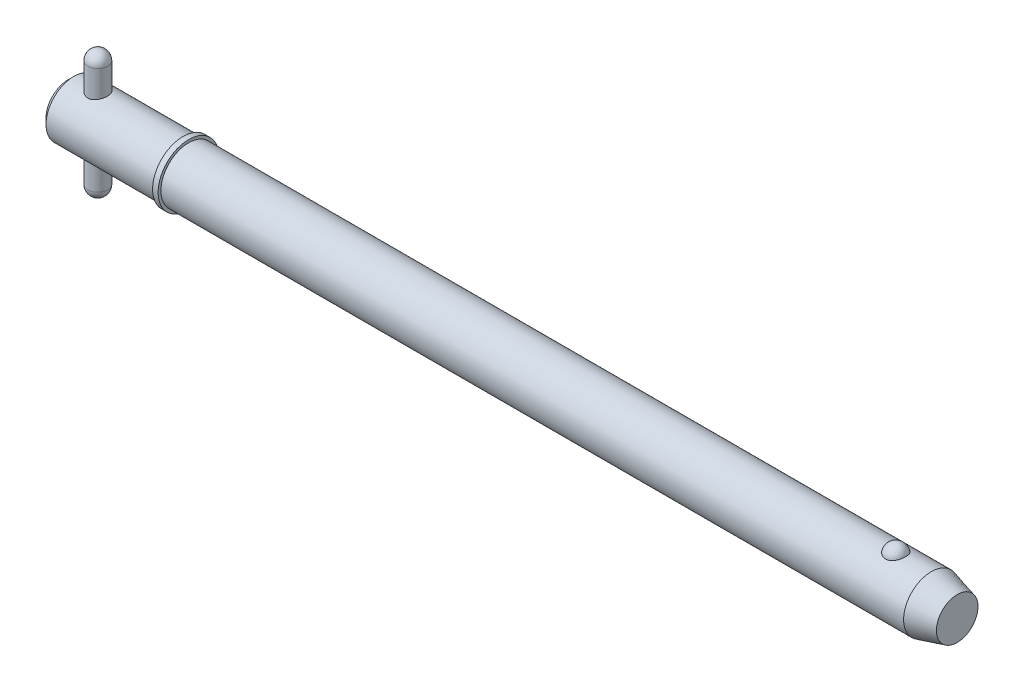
ISO-10303-21;
HEADER;
FILE_DESCRIPTION(('STEP AP214'),'2;1');
FILE_NAME('part.step','',(''),(''),'','','');
FILE_SCHEMA(('AUTOMOTIVE_DESIGN { 1 0 10303 214 1 1 1 1 }'));
ENDSEC;
DATA;
#1=APPLICATION_CONTEXT('core data for automotive mechanical design processes');
#2=APPLICATION_PROTOCOL_DEFINITION('international standard','automotive_design',2000,#1);
#3=PRODUCT_CONTEXT('',#1,'mechanical');
#4=PRODUCT('Part','Part','',(#3));
#5=PRODUCT_RELATED_PRODUCT_CATEGORY('part','',(#4));
#6=PRODUCT_DEFINITION_FORMATION('','',#4);
#7=PRODUCT_DEFINITION_CONTEXT('part definition',#1,'design');
#8=PRODUCT_DEFINITION('design','',#6,#7);
#9=PRODUCT_DEFINITION_SHAPE('','',#8);
#10=(LENGTH_UNIT() NAMED_UNIT(*) SI_UNIT(.MILLI.,.METRE.));
#11=(NAMED_UNIT(*) PLANE_ANGLE_UNIT() SI_UNIT($,.RADIAN.));
#12=(NAMED_UNIT(*) SI_UNIT($,.STERADIAN.) SOLID_ANGLE_UNIT());
#13=UNCERTAINTY_MEASURE_WITH_UNIT(LENGTH_MEASURE(1.E-05),#10,'distance_accuracy_value','');
#14=(GEOMETRIC_REPRESENTATION_CONTEXT(3) GLOBAL_UNCERTAINTY_ASSIGNED_CONTEXT((#13)) GLOBAL_UNIT_ASSIGNED_CONTEXT((#10,
#11,#12)) REPRESENTATION_CONTEXT('',''));
#15=CARTESIAN_POINT('',(0.,0.,0.));
#16=DIRECTION('',(0.,0.,1.));
#17=DIRECTION('',(1.,0.,0.));
#18=AXIS2_PLACEMENT_3D('',#15,#16,#17);
#19=CARTESIAN_POINT('',(5.94,12.7,0.));
#20=DIRECTION('',(0.,-1.,0.));
#21=DIRECTION('',(0.,0.,-1.));
#22=AXIS2_PLACEMENT_3D('',#19,#20,#21);
#23=CYLINDRICAL_SURFACE('',#22,1.98);
#24=CARTESIAN_POINT('',(5.94,-10.72,0.));
#25=DIRECTION('',(0.,-1.,0.));
#26=DIRECTION('',(0.,0.,-1.));
#27=AXIS2_PLACEMENT_3D('',#24,#25,#26);
#28=CIRCLE('',#27,1.98);
#29=CARTESIAN_POINT('',(5.94,-10.72,-1.98));
#30=VERTEX_POINT('',#29);
#31=EDGE_CURVE('P0_E10',#30,#30,#28,.F.);
#32=ORIENTED_EDGE('',*,*,#31,.T.);
#33=EDGE_LOOP('',(#32));
#34=FACE_BOUND('',#33,.T.);
#35=CARTESIAN_POINT('',(5.94,10.72,0.));
#36=DIRECTION('',(0.,-1.,0.));
#37=DIRECTION('',(0.,0.,-1.));
#38=AXIS2_PLACEMENT_3D('',#35,#36,#37);
#39=CIRCLE('',#38,1.98);
#40=CARTESIAN_POINT('',(5.94,10.72,-1.98));
#41=VERTEX_POINT('',#40);
#42=EDGE_CURVE('P0_E21',#41,#41,#39,.T.);
#43=ORIENTED_EDGE('',*,*,#42,.T.);
#44=EDGE_LOOP('',(#43));
#45=FACE_BOUND('',#44,.T.);
#46=ADVANCED_FACE('P0_F14',(#34,#45),#23,.T.);
#47=CARTESIAN_POINT('',(5.94,-10.72,0.));
#48=DIRECTION('',(0.,0.,1.));
#49=DIRECTION('',(1.,0.,0.));
#50=AXIS2_PLACEMENT_3D('',#47,#48,#49);
#51=SPHERICAL_SURFACE('',#50,1.98);
#52=CARTESIAN_POINT('',(5.94,-10.72,0.));
#53=DIRECTION('',(0.,-1.,0.));
#54=DIRECTION('',(0.,0.,-1.));
#55=AXIS2_PLACEMENT_3D('',#52,#53,#54);
#56=SPHERICAL_SURFACE('',#55,1.98);
#57=ORIENTED_EDGE('',*,*,#31,.F.);
#58=EDGE_LOOP('',(#57));
#59=FACE_BOUND('',#58,.T.);
#60=ADVANCED_FACE('P0_F29',(#59),#56,.T.);
#61=CARTESIAN_POINT('',(5.94,10.72,0.));
#62=DIRECTION('',(0.,0.,1.));
#63=DIRECTION('',(1.,0.,0.));
#64=AXIS2_PLACEMENT_3D('',#61,#62,#63);
#65=SPHERICAL_SURFACE('',#64,1.98);
#66=CARTESIAN_POINT('',(5.94,10.72,0.));
#67=DIRECTION('',(0.,-1.,0.));
#68=DIRECTION('',(0.,0.,-1.));
#69=AXIS2_PLACEMENT_3D('',#66,#67,#68);
#70=SPHERICAL_SURFACE('',#69,1.98);
#71=ORIENTED_EDGE('',*,*,#42,.F.);
#72=EDGE_LOOP('',(#71));
#73=FACE_BOUND('',#72,.T.);
#74=ADVANCED_FACE('P0_F16',(#73),#70,.T.);
#75=CLOSED_SHELL('',(#46,#60,#74));
#76=MANIFOLD_SOLID_BREP('P0_B1',#75);
#77=CARTESIAN_POINT('',(0.,0.,0.));
#78=DIRECTION('',(1.,0.,0.));
#79=DIRECTION('',(0.,0.,-1.));
#80=AXIS2_PLACEMENT_3D('',#77,#78,#79);
#81=CYLINDRICAL_SURFACE('',#80,5.555);
#82=CARTESIAN_POINT('',(172.917114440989,0.,0.));
#83=DIRECTION('',(1.,0.,0.));
#84=DIRECTION('',(0.,0.,-1.));
#85=AXIS2_PLACEMENT_3D('',#82,#83,#84);
#86=CIRCLE('',#85,5.555);
#87=CARTESIAN_POINT('',(172.917114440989,0.,-5.555));
#88=VERTEX_POINT('',#87);
#89=EDGE_CURVE('P1_E81',#88,#88,#86,.T.);
#90=ORIENTED_EDGE('',*,*,#89,.F.);
#91=EDGE_LOOP('',(#90));
#92=FACE_BOUND('',#91,.T.);
#93=CARTESIAN_POINT('',(24.13,0.,0.));
#94=DIRECTION('',(1.,0.,0.));
#95=DIRECTION('',(0.,0.,-1.));
#96=AXIS2_PLACEMENT_3D('',#93,#94,#95);
#97=CIRCLE('',#96,5.555);
#98=CARTESIAN_POINT('',(24.13,0.,-5.555));
#99=VERTEX_POINT('',#98);
#100=EDGE_CURVE('P1_E85',#99,#99,#97,.T.);
#101=ORIENTED_EDGE('',*,*,#100,.T.);
#102=EDGE_LOOP('',(#101));
#103=FACE_BOUND('',#102,.T.);
#104=CARTESIAN_POINT('',(165.798626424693,5.16741224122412,2.03859650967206));
#105=CARTESIAN_POINT('',(165.692949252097,5.16740893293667,2.03859990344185));
#106=CARTESIAN_POINT('',(165.58729894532,5.17079470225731,2.03008306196));
#107=CARTESIAN_POINT('',(165.379141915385,5.18392795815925,1.99630721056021));
#108=CARTESIAN_POINT('',(165.276634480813,5.19367399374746,1.97105201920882));
#109=CARTESIAN_POINT('',(165.077771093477,5.21839168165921,1.9046399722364));
#110=CARTESIAN_POINT('',(164.981406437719,5.23335573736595,1.8635062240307));
#111=CARTESIAN_POINT('',(164.797080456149,5.26688076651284,1.76652592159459));
#112=CARTESIAN_POINT('',(164.709120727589,5.28544242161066,1.71067657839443));
#113=CARTESIAN_POINT('',(164.541265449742,5.32479845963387,1.58399959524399));
#114=CARTESIAN_POINT('',(164.46166564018,5.34564089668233,1.51279545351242));
#115=CARTESIAN_POINT('',(164.31512901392,5.38697258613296,1.35828584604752));
#116=CARTESIAN_POINT('',(164.248194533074,5.40746177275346,1.27497815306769));
#117=CARTESIAN_POINT('',(164.12561039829,5.44694508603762,1.0944029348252));
#118=CARTESIAN_POINT('',(164.070598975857,5.46583143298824,0.996677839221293));
#119=CARTESIAN_POINT('',(163.976937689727,5.49908030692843,0.792961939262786));
#120=CARTESIAN_POINT('',(163.938289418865,5.513442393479,0.686970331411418));
#121=CARTESIAN_POINT('',(163.877680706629,5.53635851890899,0.468019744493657));
#122=CARTESIAN_POINT('',(163.855972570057,5.54482455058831,0.354981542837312));
#123=CARTESIAN_POINT('',(163.830636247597,5.55473324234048,0.12659586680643));
#124=CARTESIAN_POINT('',(163.827007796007,5.55617600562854,0.0112484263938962));
#125=CARTESIAN_POINT('',(163.837881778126,5.55189984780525,-0.218011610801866));
#126=CARTESIAN_POINT('',(163.852315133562,5.54620821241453,-0.331928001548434));
#127=CARTESIAN_POINT('',(163.898903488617,5.52828920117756,-0.555544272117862));
#128=CARTESIAN_POINT('',(163.931058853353,5.5160616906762,-0.665244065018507));
#129=CARTESIAN_POINT('',(164.012488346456,5.48630779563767,-0.877469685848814));
#130=CARTESIAN_POINT('',(164.061781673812,5.4687754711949,-0.979987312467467));
#131=CARTESIAN_POINT('',(164.176478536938,5.43024700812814,-1.17486975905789));
#132=CARTESIAN_POINT('',(164.241883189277,5.4092506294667,-1.26723387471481));
#133=CARTESIAN_POINT('',(164.387571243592,5.36600927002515,-1.4394013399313));
#134=CARTESIAN_POINT('',(164.467885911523,5.34376173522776,-1.51917763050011));
#135=CARTESIAN_POINT('',(164.641452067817,5.30057971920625,-1.66360338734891));
#136=CARTESIAN_POINT('',(164.734702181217,5.27964509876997,-1.72825445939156));
#137=CARTESIAN_POINT('',(164.929393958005,5.24205250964,-1.83909478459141));
#138=CARTESIAN_POINT('',(165.030590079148,5.22530519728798,-1.88568407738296));
#139=CARTESIAN_POINT('',(165.240155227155,5.19750919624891,-1.96100802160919));
#140=CARTESIAN_POINT('',(165.348521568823,5.1864583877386,-1.98974931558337));
#141=CARTESIAN_POINT('',(165.563498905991,5.17184410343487,-2.02742262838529));
#142=CARTESIAN_POINT('',(165.669925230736,5.1679328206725,-2.03727608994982));
#143=CARTESIAN_POINT('',(165.882992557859,5.16698995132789,-2.03966777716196));
#144=CARTESIAN_POINT('',(165.989633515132,5.16995704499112,-2.0322093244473));
#145=CARTESIAN_POINT('',(166.196773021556,5.18222383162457,-2.00071170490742));
#146=CARTESIAN_POINT('',(166.297359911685,5.19133213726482,-1.97717337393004));
#147=CARTESIAN_POINT('',(166.493014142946,5.21467637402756,-1.91475248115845));
#148=CARTESIAN_POINT('',(166.588081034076,5.22891272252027,-1.87586867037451));
#149=CARTESIAN_POINT('',(166.772371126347,5.26137066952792,-1.78282713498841));
#150=CARTESIAN_POINT('',(166.861419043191,5.27967329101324,-1.72835124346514));
#151=CARTESIAN_POINT('',(167.029288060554,5.3181741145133,-1.60597483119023));
#152=CARTESIAN_POINT('',(167.108106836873,5.33837274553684,-1.5380712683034));
#153=CARTESIAN_POINT('',(167.257515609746,5.37968287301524,-1.38688970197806));
#154=CARTESIAN_POINT('',(167.327505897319,5.40079011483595,-1.30301744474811));
#155=CARTESIAN_POINT('',(167.453012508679,5.44074401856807,-1.12458170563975));
#156=CARTESIAN_POINT('',(167.508526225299,5.45959027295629,-1.03001630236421));
#157=CARTESIAN_POINT('',(167.605550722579,5.49369849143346,-0.829439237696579));
#158=CARTESIAN_POINT('',(167.646548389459,5.50882422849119,-0.723155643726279));
#159=CARTESIAN_POINT('',(167.711125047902,5.53310911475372,-0.504772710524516));
#160=CARTESIAN_POINT('',(167.734703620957,5.54226812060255,-0.392673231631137));
#161=CARTESIAN_POINT('',(167.764013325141,5.55370358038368,-0.165459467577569));
#162=CARTESIAN_POINT('',(167.769688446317,5.55595843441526,-0.0503368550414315));
#163=CARTESIAN_POINT('',(167.762916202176,5.55329317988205,0.179288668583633));
#164=CARTESIAN_POINT('',(167.750469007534,5.54837313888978,0.293791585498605));
#165=CARTESIAN_POINT('',(167.707779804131,5.53189037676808,0.51852641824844));
#166=CARTESIAN_POINT('',(167.677598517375,5.5203503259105,0.62877154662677));
#167=CARTESIAN_POINT('',(167.600096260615,5.49182453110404,0.842318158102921));
#168=CARTESIAN_POINT('',(167.552774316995,5.47483847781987,0.945619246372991));
#169=CARTESIAN_POINT('',(167.441720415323,5.43710633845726,1.14281571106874));
#170=CARTESIAN_POINT('',(167.377921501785,5.41634501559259,1.23667048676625));
#171=CARTESIAN_POINT('',(167.235357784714,5.37334572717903,1.4118524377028));
#172=CARTESIAN_POINT('',(167.15659323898,5.35110778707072,1.49317982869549));
#173=CARTESIAN_POINT('',(166.986423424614,5.30779474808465,1.64049162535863));
#174=CARTESIAN_POINT('',(166.89510026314,5.28671324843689,1.70656877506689));
#175=CARTESIAN_POINT('',(166.701739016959,5.2480485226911,1.82201372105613));
#176=CARTESIAN_POINT('',(166.599700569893,5.23046541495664,1.87138095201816));
#177=CARTESIAN_POINT('',(166.383618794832,5.20042692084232,1.95335298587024));
#178=CARTESIAN_POINT('',(166.269260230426,5.18820192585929,1.98521734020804));
#179=CARTESIAN_POINT('',(166.036130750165,5.17169804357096,2.02783294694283));
#180=CARTESIAN_POINT('',(165.917361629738,5.16741595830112,2.03859269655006));
#181=CARTESIAN_POINT('',(165.798626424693,5.16741224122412,2.03859650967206));
#182=B_SPLINE_CURVE_WITH_KNOTS('',3,(#104,#105,#106,#107,#108,#109,#110,#111,#112,#113,#114,
#115,#116,#117,#118,#119,#120,#121,#122,#123,#124,#125,#126,#127,#128,#129,#130,#131,#132,#133,
#134,#135,#136,#137,#138,#139,#140,#141,#142,#143,#144,#145,#146,#147,#148,#149,#150,#151,#152,
#153,#154,#155,#156,#157,#158,#159,#160,#161,#162,#163,#164,#165,#166,#167,#168,#169,#170,#171,
#172,#173,#174,#175,#176,#177,#178,#179,#180,#181),.UNSPECIFIED.,.T.,.F.,(4,2,2,2,2,2,2,2,2,2,2,
2,2,2,2,2,2,2,2,2,2,2,2,2,2,2,2,2,2,2,2,2,2,2,2,2,2,2,4),(0.,0.316595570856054,
0.633118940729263,0.94918341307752,1.26530783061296,1.59030762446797,1.91536729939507,
2.25495824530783,2.59458224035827,2.93917283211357,3.28375835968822,3.62703002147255,
3.97030875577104,4.31397329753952,4.657661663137,5.00207904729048,5.34645984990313,
5.68270547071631,6.01882587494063,6.33808403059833,6.65728093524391,6.9669637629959,
7.27667180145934,7.59321535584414,7.90983070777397,8.24210387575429,8.57443684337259,
8.91755896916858,9.26068933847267,9.60489211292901,9.94909164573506,10.2921194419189,
10.6351667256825,10.9796305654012,11.3240884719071,11.6663928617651,12.0087088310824,
12.3645679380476,12.7202837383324),.UNSPECIFIED.);
#183=CARTESIAN_POINT('',(165.798626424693,5.16741224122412,2.03859650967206));
#184=VERTEX_POINT('',#183);
#185=EDGE_CURVE('P1_E35',#184,#184,#182,.T.);
#186=ORIENTED_EDGE('',*,*,#185,.T.);
#187=EDGE_LOOP('',(#186));
#188=FACE_BOUND('',#187,.T.);
#189=ADVANCED_FACE('P1_F13',(#92,#103,#188),#81,.T.);
#190=CARTESIAN_POINT('',(0.,0.,0.));
#191=DIRECTION('',(-1.,0.,0.));
#192=DIRECTION('',(0.,0.,1.));
#193=AXIS2_PLACEMENT_3D('',#190,#191,#192);
#194=PLANE('',#193);
#195=CARTESIAN_POINT('',(0.,0.,0.));
#196=DIRECTION('',(1.,0.,0.));
#197=DIRECTION('',(0.,0.,-1.));
#198=AXIS2_PLACEMENT_3D('',#195,#196,#197);
#199=CIRCLE('',#198,4.444);
#200=CARTESIAN_POINT('',(0.,0.,-4.444));
#201=VERTEX_POINT('',#200);
#202=EDGE_CURVE('P1_E9',#201,#201,#199,.T.);
#203=ORIENTED_EDGE('',*,*,#202,.F.);
#204=EDGE_LOOP('',(#203));
#205=FACE_BOUND('',#204,.T.);
#206=ADVANCED_FACE('P1_F15',(#205),#194,.T.);
#207=CARTESIAN_POINT('',(1.111,0.,0.));
#208=DIRECTION('',(1.,0.,0.));
#209=DIRECTION('',(0.,0.,-1.));
#210=AXIS2_PLACEMENT_3D('',#207,#208,#209);
#211=CONICAL_SURFACE('',#210,5.555,0.78539816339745);
#212=ORIENTED_EDGE('',*,*,#202,.T.);
#213=EDGE_LOOP('',(#212));
#214=FACE_BOUND('',#213,.T.);
#215=CARTESIAN_POINT('',(1.111,0.,0.));
#216=DIRECTION('',(1.,0.,0.));
#217=DIRECTION('',(0.,0.,-1.));
#218=AXIS2_PLACEMENT_3D('',#215,#216,#217);
#219=CIRCLE('',#218,5.555);
#220=CARTESIAN_POINT('',(1.111,0.,-5.555));
#221=VERTEX_POINT('',#220);
#222=EDGE_CURVE('P1_E26',#221,#221,#219,.T.);
#223=ORIENTED_EDGE('',*,*,#222,.F.);
#224=EDGE_LOOP('',(#223));
#225=FACE_BOUND('',#224,.T.);
#226=ADVANCED_FACE('P1_F77',(#214,#225),#211,.T.);
#227=CARTESIAN_POINT('',(0.,0.,0.));
#228=DIRECTION('',(1.,0.,0.));
#229=DIRECTION('',(0.,0.,-1.));
#230=AXIS2_PLACEMENT_3D('',#227,#228,#229);
#231=CYLINDRICAL_SURFACE('',#230,5.555);
#232=CARTESIAN_POINT('',(5.94,-5.19014691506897,1.98));
#233=CARTESIAN_POINT('',(5.83264687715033,-5.19014494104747,1.98000226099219));
#234=CARTESIAN_POINT('',(5.7253094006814,-5.19351395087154,1.97123988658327));
#235=CARTESIAN_POINT('',(5.51384517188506,-5.20654291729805,1.93656219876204));
#236=CARTESIAN_POINT('',(5.40971858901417,-5.21620320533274,1.91064598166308));
#237=CARTESIAN_POINT('',(5.20778082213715,-5.24058443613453,1.84271148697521));
#238=CARTESIAN_POINT('',(5.10995634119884,-5.25529427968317,1.80072850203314));
#239=CARTESIAN_POINT('',(4.92270352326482,-5.28810012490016,1.70197537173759));
#240=CARTESIAN_POINT('',(4.83327743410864,-5.3061970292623,1.64520128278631));
#241=CARTESIAN_POINT('',(4.66135184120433,-5.34464714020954,1.51575187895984));
#242=CARTESIAN_POINT('',(4.57928277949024,-5.36506222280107,1.44252311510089));
#243=CARTESIAN_POINT('',(4.42829115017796,-5.40532920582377,1.28342047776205));
#244=CARTESIAN_POINT('',(4.35937105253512,-5.42518099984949,1.19754423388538));
#245=CARTESIAN_POINT('',(4.23461605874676,-5.46281133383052,1.01237205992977));
#246=CARTESIAN_POINT('',(4.17924129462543,-5.48050875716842,0.912748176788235));
#247=CARTESIAN_POINT('',(4.0862117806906,-5.51109938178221,0.70485824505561));
#248=CARTESIAN_POINT('',(4.0485515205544,-5.52399407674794,0.596594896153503));
#249=CARTESIAN_POINT('',(3.99350662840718,-5.54308759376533,0.379019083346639));
#250=CARTESIAN_POINT('',(3.97538263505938,-5.54952987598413,0.269915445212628));
#251=CARTESIAN_POINT('',(3.95756405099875,-5.55586205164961,0.0500378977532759));
#252=CARTESIAN_POINT('',(3.95786404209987,-5.55575387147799,-0.060735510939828));
#253=CARTESIAN_POINT('',(3.97643665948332,-5.54915684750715,-0.275539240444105));
#254=CARTESIAN_POINT('',(3.99390415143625,-5.54295384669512,-0.379649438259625));
#255=CARTESIAN_POINT('',(4.0449721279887,-5.52523170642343,-0.583350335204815));
#256=CARTESIAN_POINT('',(4.07857373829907,-5.51371219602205,-0.682940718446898));
#257=CARTESIAN_POINT('',(4.16137312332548,-5.4863099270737,-0.876423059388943));
#258=CARTESIAN_POINT('',(4.2107826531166,-5.47036834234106,-0.970215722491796));
#259=CARTESIAN_POINT('',(4.32361427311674,-5.43575653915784,-1.1484017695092));
#260=CARTESIAN_POINT('',(4.38704062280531,-5.41708549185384,-1.23279228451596));
#261=CARTESIAN_POINT('',(4.53006791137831,-5.37778429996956,-1.39454579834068));
#262=CARTESIAN_POINT('',(4.61035105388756,-5.35710277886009,-1.4712940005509));
#263=CARTESIAN_POINT('',(4.78279835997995,-5.31692766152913,-1.6104545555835));
#264=CARTESIAN_POINT('',(4.874964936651,-5.29743430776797,-1.67286398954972));
#265=CARTESIAN_POINT('',(5.07076688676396,-5.26153775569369,-1.78259698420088));
#266=CARTESIAN_POINT('',(5.17458163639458,-5.24519780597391,-1.8296227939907));
#267=CARTESIAN_POINT('',(5.38938990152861,-5.21818744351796,-1.90530278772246));
#268=CARTESIAN_POINT('',(5.50037985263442,-5.20751423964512,-1.93396601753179));
#269=CARTESIAN_POINT('',(5.72036376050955,-5.19369176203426,-1.97077654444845));
#270=CARTESIAN_POINT('',(5.82917370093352,-5.19018851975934,-1.97989015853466));
#271=CARTESIAN_POINT('',(6.04680100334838,-5.19010609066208,-1.98010779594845));
#272=CARTESIAN_POINT('',(6.15561835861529,-5.19352540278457,-1.97121572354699));
#273=CARTESIAN_POINT('',(6.36548036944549,-5.20654623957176,-1.93654727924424));
#274=CARTESIAN_POINT('',(6.46666051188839,-5.21588705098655,-1.91148218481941));
#275=CARTESIAN_POINT('',(6.66334537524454,-5.23939939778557,-1.84605494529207));
#276=CARTESIAN_POINT('',(6.75884899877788,-5.25357186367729,-1.8056898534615));
#277=CARTESIAN_POINT('',(6.94517989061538,-5.28576258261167,-1.70921153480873));
#278=CARTESIAN_POINT('',(7.03572661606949,-5.30389804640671,-1.65259670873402));
#279=CARTESIAN_POINT('',(7.20638087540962,-5.34176077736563,-1.52577523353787));
#280=CARTESIAN_POINT('',(7.28648490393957,-5.36148857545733,-1.45556404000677));
#281=CARTESIAN_POINT('',(7.43864697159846,-5.40165494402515,-1.2988614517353));
#282=CARTESIAN_POINT('',(7.50999887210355,-5.42207106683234,-1.21167640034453));
#283=CARTESIAN_POINT('',(7.63712639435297,-5.46023601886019,-1.026066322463));
#284=CARTESIAN_POINT('',(7.69290228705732,-5.47798489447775,-0.927641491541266));
#285=CARTESIAN_POINT('',(7.78684673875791,-5.50876590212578,-0.722633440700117));
#286=CARTESIAN_POINT('',(7.82510508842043,-5.52182201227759,-0.616095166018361));
#287=CARTESIAN_POINT('',(7.88297051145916,-5.54184206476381,-0.397530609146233));
#288=CARTESIAN_POINT('',(7.90258540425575,-5.5488085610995,-0.285506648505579));
#289=CARTESIAN_POINT('',(7.9218262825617,-5.55564472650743,-0.065566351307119));
#290=CARTESIAN_POINT('',(7.92245987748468,-5.55587212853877,0.0422515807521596));
#291=CARTESIAN_POINT('',(7.90626329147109,-5.55011340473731,0.256387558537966));
#292=CARTESIAN_POINT('',(7.88943488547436,-5.54412791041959,0.362705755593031));
#293=CARTESIAN_POINT('',(7.83948457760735,-5.52676548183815,0.568649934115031));
#294=CARTESIAN_POINT('',(7.8067003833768,-5.51550046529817,0.668367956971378));
#295=CARTESIAN_POINT('',(7.72609369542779,-5.48874437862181,0.860911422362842));
#296=CARTESIAN_POINT('',(7.67826838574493,-5.47325251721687,0.953735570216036));
#297=CARTESIAN_POINT('',(7.56675024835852,-5.43884382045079,1.13391068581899));
#298=CARTESIAN_POINT('',(7.50249968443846,-5.41981485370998,1.22089468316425));
#299=CARTESIAN_POINT('',(7.36086495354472,-5.38069275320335,1.38316665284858));
#300=CARTESIAN_POINT('',(7.28347630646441,-5.36059925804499,1.45845061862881));
#301=CARTESIAN_POINT('',(7.11347587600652,-5.32048380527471,1.59876646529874));
#302=CARTESIAN_POINT('',(7.02032386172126,-5.30050854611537,1.66315951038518));
#303=CARTESIAN_POINT('',(6.82388804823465,-5.26398994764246,1.77536801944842));
#304=CARTESIAN_POINT('',(6.7206049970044,-5.24744635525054,1.82318470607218));
#305=CARTESIAN_POINT('',(6.50639706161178,-5.21987969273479,1.90068230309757));
#306=CARTESIAN_POINT('',(6.3954529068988,-5.20887116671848,1.93031547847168));
#307=CARTESIAN_POINT('',(6.16966522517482,-5.19400760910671,1.96996824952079));
#308=CARTESIAN_POINT('',(6.05482366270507,-5.19014902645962,1.97999758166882));
#309=CARTESIAN_POINT('',(5.94,-5.19014691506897,1.98));
#310=B_SPLINE_CURVE_WITH_KNOTS('',3,(#232,#233,#234,#235,#236,#237,#238,#239,#240,#241,#242,
#243,#244,#245,#246,#247,#248,#249,#250,#251,#252,#253,#254,#255,#256,#257,#258,#259,#260,#261,
#262,#263,#264,#265,#266,#267,#268,#269,#270,#271,#272,#273,#274,#275,#276,#277,#278,#279,#280,
#281,#282,#283,#284,#285,#286,#287,#288,#289,#290,#291,#292,#293,#294,#295,#296,#297,#298,#299,
#300,#301,#302,#303,#304,#305,#306,#307,#308,#309),.UNSPECIFIED.,.T.,.F.,(4,2,2,2,2,2,2,2,2,2,2,
2,2,2,2,2,2,2,2,2,2,2,2,2,2,2,2,2,2,2,2,2,2,2,2,2,2,2,4),(0.,0.321632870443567,
0.643282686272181,0.964229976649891,1.28526292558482,1.61937087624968,1.9535415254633,
2.29784481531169,2.64204093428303,2.97269632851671,3.30325448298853,3.61901541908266,
3.93479838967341,4.25500220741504,4.57530346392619,4.91268648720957,5.25013812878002,
5.59378026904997,5.93725299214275,6.26331481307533,6.58930593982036,6.90185604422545,
7.21446637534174,7.53801472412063,7.86167140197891,8.20353561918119,8.54539388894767,
8.88547970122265,9.22542281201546,9.54728637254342,9.86911722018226,10.1844146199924,
10.4997710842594,10.827730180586,11.1558013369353,11.499115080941,11.8424034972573,
12.1865892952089,12.5306041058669),.UNSPECIFIED.);
#311=CARTESIAN_POINT('',(5.94,-5.19014691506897,1.98));
#312=VERTEX_POINT('',#311);
#313=EDGE_CURVE('P1_E17',#312,#312,#310,.T.);
#314=ORIENTED_EDGE('',*,*,#313,.F.);
#315=EDGE_LOOP('',(#314));
#316=FACE_BOUND('',#315,.T.);
#317=CARTESIAN_POINT('',(5.94,5.19014691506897,1.98));
#318=CARTESIAN_POINT('',(6.04735312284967,5.19014494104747,1.98000226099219));
#319=CARTESIAN_POINT('',(6.1546905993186,5.19351395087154,1.97123988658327));
#320=CARTESIAN_POINT('',(6.36615482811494,5.20654291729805,1.93656219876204));
#321=CARTESIAN_POINT('',(6.47028141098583,5.21620320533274,1.91064598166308));
#322=CARTESIAN_POINT('',(6.67221917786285,5.24058443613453,1.84271148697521));
#323=CARTESIAN_POINT('',(6.77004365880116,5.25529427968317,1.80072850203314));
#324=CARTESIAN_POINT('',(6.95729647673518,5.28810012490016,1.70197537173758));
#325=CARTESIAN_POINT('',(7.04672256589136,5.3061970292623,1.64520128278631));
#326=CARTESIAN_POINT('',(7.21864815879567,5.34464714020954,1.51575187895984));
#327=CARTESIAN_POINT('',(7.30071722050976,5.36506222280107,1.44252311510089));
#328=CARTESIAN_POINT('',(7.45170884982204,5.40532920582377,1.28342047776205));
#329=CARTESIAN_POINT('',(7.52062894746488,5.42518099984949,1.19754423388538));
#330=CARTESIAN_POINT('',(7.64538394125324,5.46281133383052,1.01237205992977));
#331=CARTESIAN_POINT('',(7.70075870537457,5.48050875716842,0.912748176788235));
#332=CARTESIAN_POINT('',(7.7937882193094,5.51109938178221,0.704858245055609));
#333=CARTESIAN_POINT('',(7.8314484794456,5.52399407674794,0.596594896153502));
#334=CARTESIAN_POINT('',(7.88649337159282,5.54308759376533,0.379019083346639));
#335=CARTESIAN_POINT('',(7.90461736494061,5.54952987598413,0.269915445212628));
#336=CARTESIAN_POINT('',(7.92243594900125,5.55586205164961,0.0500378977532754));
#337=CARTESIAN_POINT('',(7.92213595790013,5.55575387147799,-0.0607355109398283));
#338=CARTESIAN_POINT('',(7.90356334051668,5.54915684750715,-0.275539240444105));
#339=CARTESIAN_POINT('',(7.88609584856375,5.54295384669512,-0.379649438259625));
#340=CARTESIAN_POINT('',(7.8350278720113,5.52523170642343,-0.583350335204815));
#341=CARTESIAN_POINT('',(7.80142626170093,5.51371219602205,-0.682940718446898));
#342=CARTESIAN_POINT('',(7.71862687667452,5.4863099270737,-0.876423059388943));
#343=CARTESIAN_POINT('',(7.6692173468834,5.47036834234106,-0.970215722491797));
#344=CARTESIAN_POINT('',(7.55638572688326,5.43575653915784,-1.1484017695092));
#345=CARTESIAN_POINT('',(7.49295937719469,5.41708549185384,-1.23279228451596));
#346=CARTESIAN_POINT('',(7.34993208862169,5.37778429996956,-1.39454579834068));
#347=CARTESIAN_POINT('',(7.26964894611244,5.35710277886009,-1.4712940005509));
#348=CARTESIAN_POINT('',(7.09720164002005,5.31692766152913,-1.6104545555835));
#349=CARTESIAN_POINT('',(7.00503506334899,5.29743430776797,-1.67286398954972));
#350=CARTESIAN_POINT('',(6.80923311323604,5.26153775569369,-1.78259698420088));
#351=CARTESIAN_POINT('',(6.70541836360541,5.24519780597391,-1.8296227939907));
#352=CARTESIAN_POINT('',(6.49061009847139,5.21818744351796,-1.90530278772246));
#353=CARTESIAN_POINT('',(6.37962014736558,5.20751423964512,-1.93396601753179));
#354=CARTESIAN_POINT('',(6.15963623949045,5.19369176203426,-1.97077654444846));
#355=CARTESIAN_POINT('',(6.05082629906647,5.19018851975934,-1.97989015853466));
#356=CARTESIAN_POINT('',(5.83319899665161,5.19010609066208,-1.98010779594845));
#357=CARTESIAN_POINT('',(5.7243816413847,5.19352540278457,-1.97121572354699));
#358=CARTESIAN_POINT('',(5.5145196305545,5.20654623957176,-1.93654727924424));
#359=CARTESIAN_POINT('',(5.4133394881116,5.21588705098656,-1.91148218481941));
#360=CARTESIAN_POINT('',(5.21665462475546,5.23939939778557,-1.84605494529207));
#361=CARTESIAN_POINT('',(5.12115100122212,5.25357186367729,-1.8056898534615));
#362=CARTESIAN_POINT('',(4.93482010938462,5.28576258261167,-1.70921153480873));
#363=CARTESIAN_POINT('',(4.84427338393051,5.30389804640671,-1.65259670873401));
#364=CARTESIAN_POINT('',(4.67361912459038,5.34176077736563,-1.52577523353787));
#365=CARTESIAN_POINT('',(4.59351509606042,5.36148857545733,-1.45556404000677));
#366=CARTESIAN_POINT('',(4.44135302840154,5.40165494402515,-1.2988614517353));
#367=CARTESIAN_POINT('',(4.37000112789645,5.42207106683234,-1.21167640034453));
#368=CARTESIAN_POINT('',(4.24287360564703,5.46023601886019,-1.026066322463));
#369=CARTESIAN_POINT('',(4.18709771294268,5.47798489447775,-0.927641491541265));
#370=CARTESIAN_POINT('',(4.09315326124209,5.50876590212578,-0.722633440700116));
#371=CARTESIAN_POINT('',(4.05489491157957,5.52182201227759,-0.61609516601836));
#372=CARTESIAN_POINT('',(3.99702948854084,5.54184206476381,-0.397530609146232));
#373=CARTESIAN_POINT('',(3.97741459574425,5.5488085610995,-0.285506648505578));
#374=CARTESIAN_POINT('',(3.9581737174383,5.55564472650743,-0.0655663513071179));
#375=CARTESIAN_POINT('',(3.95754012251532,5.55587212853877,0.0422515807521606));
#376=CARTESIAN_POINT('',(3.97373670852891,5.55011340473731,0.256387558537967));
#377=CARTESIAN_POINT('',(3.99056511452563,5.54412791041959,0.362705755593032));
#378=CARTESIAN_POINT('',(4.04051542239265,5.52676548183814,0.568649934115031));
#379=CARTESIAN_POINT('',(4.07329961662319,5.51550046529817,0.668367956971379));
#380=CARTESIAN_POINT('',(4.15390630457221,5.48874437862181,0.860911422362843));
#381=CARTESIAN_POINT('',(4.20173161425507,5.47325251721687,0.953735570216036));
#382=CARTESIAN_POINT('',(4.31324975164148,5.43884382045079,1.13391068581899));
#383=CARTESIAN_POINT('',(4.37750031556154,5.41981485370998,1.22089468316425));
#384=CARTESIAN_POINT('',(4.51913504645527,5.38069275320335,1.38316665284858));
#385=CARTESIAN_POINT('',(4.59652369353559,5.36059925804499,1.45845061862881));
#386=CARTESIAN_POINT('',(4.76652412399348,5.32048380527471,1.59876646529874));
#387=CARTESIAN_POINT('',(4.85967613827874,5.30050854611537,1.66315951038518));
#388=CARTESIAN_POINT('',(5.05611195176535,5.26398994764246,1.77536801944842));
#389=CARTESIAN_POINT('',(5.1593950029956,5.24744635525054,1.82318470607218));
#390=CARTESIAN_POINT('',(5.37360293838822,5.21987969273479,1.90068230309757));
#391=CARTESIAN_POINT('',(5.4845470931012,5.20887116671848,1.93031547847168));
#392=CARTESIAN_POINT('',(5.71033477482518,5.19400760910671,1.96996824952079));
#393=CARTESIAN_POINT('',(5.82517633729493,5.19014902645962,1.97999758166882));
#394=CARTESIAN_POINT('',(5.94,5.19014691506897,1.98));
#395=B_SPLINE_CURVE_WITH_KNOTS('',3,(#317,#318,#319,#320,#321,#322,#323,#324,#325,#326,#327,
#328,#329,#330,#331,#332,#333,#334,#335,#336,#337,#338,#339,#340,#341,#342,#343,#344,#345,#346,
#347,#348,#349,#350,#351,#352,#353,#354,#355,#356,#357,#358,#359,#360,#361,#362,#363,#364,#365,
#366,#367,#368,#369,#370,#371,#372,#373,#374,#375,#376,#377,#378,#379,#380,#381,#382,#383,#384,
#385,#386,#387,#388,#389,#390,#391,#392,#393,#394),.UNSPECIFIED.,.T.,.F.,(4,2,2,2,2,2,2,2,2,2,2,
2,2,2,2,2,2,2,2,2,2,2,2,2,2,2,2,2,2,2,2,2,2,2,2,2,2,2,4),(0.,0.321632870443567,
0.643282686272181,0.964229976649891,1.28526292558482,1.61937087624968,1.9535415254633,
2.29784481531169,2.64204093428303,2.97269632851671,3.30325448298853,3.61901541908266,
3.93479838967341,4.25500220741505,4.57530346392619,4.91268648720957,5.25013812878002,
5.59378026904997,5.93725299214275,6.26331481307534,6.58930593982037,6.90185604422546,
7.21446637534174,7.53801472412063,7.86167140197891,8.20353561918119,8.54539388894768,
8.88547970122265,9.22542281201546,9.54728637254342,9.86911722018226,10.1844146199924,
10.4997710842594,10.827730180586,11.1558013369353,11.499115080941,11.8424034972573,
12.1865892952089,12.5306041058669),.UNSPECIFIED.);
#396=CARTESIAN_POINT('',(5.94,5.19014691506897,1.98));
#397=VERTEX_POINT('',#396);
#398=EDGE_CURVE('P1_E43',#397,#397,#395,.T.);
#399=ORIENTED_EDGE('',*,*,#398,.F.);
#400=EDGE_LOOP('',(#399));
#401=FACE_BOUND('',#400,.T.);
#402=ORIENTED_EDGE('',*,*,#222,.T.);
#403=EDGE_LOOP('',(#402));
#404=FACE_BOUND('',#403,.T.);
#405=CARTESIAN_POINT('',(23.019,0.,0.));
#406=DIRECTION('',(1.,0.,0.));
#407=DIRECTION('',(0.,0.,-1.));
#408=AXIS2_PLACEMENT_3D('',#405,#406,#407);
#409=CIRCLE('',#408,5.555);
#410=CARTESIAN_POINT('',(23.019,0.,-5.555));
#411=VERTEX_POINT('',#410);
#412=EDGE_CURVE('P1_E31',#411,#411,#409,.T.);
#413=ORIENTED_EDGE('',*,*,#412,.F.);
#414=EDGE_LOOP('',(#413));
#415=FACE_BOUND('',#414,.T.);
#416=ADVANCED_FACE('P1_F103',(#316,#401,#404,#415),#231,.T.);
#417=CARTESIAN_POINT('',(23.019,5.555,0.));
#418=DIRECTION('',(-1.,0.,0.));
#419=DIRECTION('',(0.,0.,1.));
#420=AXIS2_PLACEMENT_3D('',#417,#418,#419);
#421=PLANE('',#420);
#422=ORIENTED_EDGE('',*,*,#412,.T.);
#423=EDGE_LOOP('',(#422));
#424=FACE_BOUND('',#423,.T.);
#425=CARTESIAN_POINT('',(23.019,0.,0.));
#426=DIRECTION('',(1.,0.,0.));
#427=DIRECTION('',(0.,0.,-1.));
#428=AXIS2_PLACEMENT_3D('',#425,#426,#427);
#429=CIRCLE('',#428,6.1105);
#430=CARTESIAN_POINT('',(23.019,0.,-6.1105));
#431=VERTEX_POINT('',#430);
#432=EDGE_CURVE('P1_E91',#431,#431,#429,.T.);
#433=ORIENTED_EDGE('',*,*,#432,.F.);
#434=EDGE_LOOP('',(#433));
#435=FACE_BOUND('',#434,.T.);
#436=ADVANCED_FACE('P1_F100',(#424,#435),#421,.T.);
#437=CARTESIAN_POINT('',(0.,0.,0.));
#438=DIRECTION('',(1.,0.,0.));
#439=DIRECTION('',(0.,0.,-1.));
#440=AXIS2_PLACEMENT_3D('',#437,#438,#439);
#441=CYLINDRICAL_SURFACE('',#440,6.1105);
#442=ORIENTED_EDGE('',*,*,#432,.T.);
#443=EDGE_LOOP('',(#442));
#444=FACE_BOUND('',#443,.T.);
#445=CARTESIAN_POINT('',(24.13,0.,0.));
#446=DIRECTION('',(1.,0.,0.));
#447=DIRECTION('',(0.,0.,-1.));
#448=AXIS2_PLACEMENT_3D('',#445,#446,#447);
#449=CIRCLE('',#448,6.1105);
#450=CARTESIAN_POINT('',(24.13,0.,-6.1105));
#451=VERTEX_POINT('',#450);
#452=EDGE_CURVE('P1_E88',#451,#451,#449,.T.);
#453=ORIENTED_EDGE('',*,*,#452,.F.);
#454=EDGE_LOOP('',(#453));
#455=FACE_BOUND('',#454,.T.);
#456=ADVANCED_FACE('P1_F68',(#444,#455),#441,.T.);
#457=CARTESIAN_POINT('',(24.13,6.1105,0.));
#458=DIRECTION('',(1.,0.,0.));
#459=DIRECTION('',(0.,0.,-1.));
#460=AXIS2_PLACEMENT_3D('',#457,#458,#459);
#461=PLANE('',#460);
#462=ORIENTED_EDGE('',*,*,#452,.T.);
#463=EDGE_LOOP('',(#462));
#464=FACE_BOUND('',#463,.T.);
#465=ORIENTED_EDGE('',*,*,#100,.F.);
#466=EDGE_LOOP('',(#465));
#467=FACE_BOUND('',#466,.T.);
#468=ADVANCED_FACE('P1_F62',(#464,#467),#461,.T.);
#469=CARTESIAN_POINT('',(178.1,0.,0.));
#470=DIRECTION('',(-1.,0.,0.));
#471=DIRECTION('',(0.,0.,1.));
#472=AXIS2_PLACEMENT_3D('',#469,#470,#471);
#473=CONICAL_SURFACE('',#472,4.16625000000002,0.26179938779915);
#474=ORIENTED_EDGE('',*,*,#89,.T.);
#475=EDGE_LOOP('',(#474));
#476=FACE_BOUND('',#475,.T.);
#477=CARTESIAN_POINT('',(178.1,0.,0.));
#478=DIRECTION('',(1.,0.,0.));
#479=DIRECTION('',(0.,0.,-1.));
#480=AXIS2_PLACEMENT_3D('',#477,#478,#479);
#481=CIRCLE('',#480,4.16625000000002);
#482=CARTESIAN_POINT('',(178.1,0.,-4.16625000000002));
#483=VERTEX_POINT('',#482);
#484=EDGE_CURVE('P1_E42',#483,#483,#481,.T.);
#485=ORIENTED_EDGE('',*,*,#484,.F.);
#486=EDGE_LOOP('',(#485));
#487=FACE_BOUND('',#486,.T.);
#488=ADVANCED_FACE('P1_F59',(#476,#487),#473,.T.);
#489=CARTESIAN_POINT('',(178.1,4.16625000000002,0.));
#490=DIRECTION('',(1.,0.,0.));
#491=DIRECTION('',(0.,0.,-1.));
#492=AXIS2_PLACEMENT_3D('',#489,#490,#491);
#493=PLANE('',#492);
#494=ORIENTED_EDGE('',*,*,#484,.T.);
#495=EDGE_LOOP('',(#494));
#496=FACE_BOUND('',#495,.T.);
#497=ADVANCED_FACE('P1_F55',(#496),#493,.T.);
#498=CARTESIAN_POINT('',(165.798626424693,4.9995,0.));
#499=DIRECTION('',(-1.,0.,0.));
#500=DIRECTION('',(0.,1.,0.));
#501=AXIS2_PLACEMENT_3D('',#498,#499,#500);
#502=SPHERICAL_SURFACE('',#501,2.04550000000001);
#503=ORIENTED_EDGE('',*,*,#185,.F.);
#504=EDGE_LOOP('',(#503));
#505=FACE_BOUND('',#504,.T.);
#506=ADVANCED_FACE('P1_F50',(#505),#502,.T.);
#507=CARTESIAN_POINT('',(5.94,-6.1105,0.));
#508=DIRECTION('',(0.,1.,0.));
#509=DIRECTION('',(0.,0.,1.));
#510=AXIS2_PLACEMENT_3D('',#507,#508,#509);
#511=CYLINDRICAL_SURFACE('',#510,1.98);
#512=ORIENTED_EDGE('',*,*,#313,.T.);
#513=EDGE_LOOP('',(#512));
#514=FACE_BOUND('',#513,.T.);
#515=ORIENTED_EDGE('',*,*,#398,.T.);
#516=EDGE_LOOP('',(#515));
#517=FACE_BOUND('',#516,.T.);
#518=ADVANCED_FACE('P1_F54',(#514,#517),#511,.F.);
#519=CLOSED_SHELL('',(#189,#206,#226,#416,#436,#456,#468,#488,#497,#506,#518));
#520=MANIFOLD_SOLID_BREP('P1_B1',#519);
#521=ADVANCED_BREP_SHAPE_REPRESENTATION('',(#18,#76,#520),#14);
#522=SHAPE_DEFINITION_REPRESENTATION(#9,#521);
ENDSEC;
END-ISO-10303-21;
